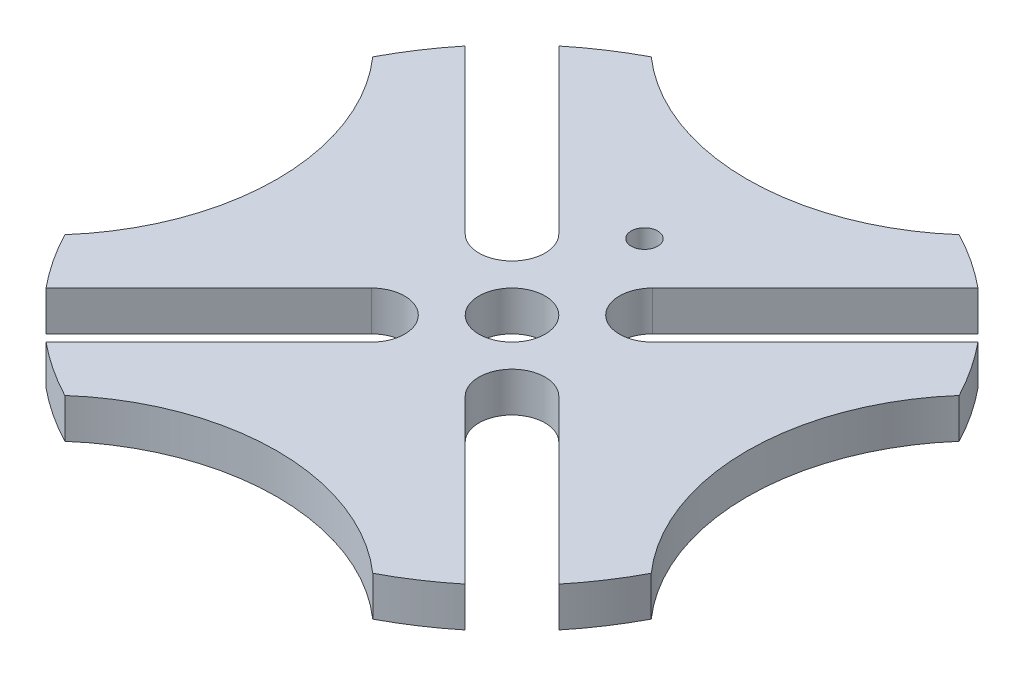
ISO-10303-21;
HEADER;
FILE_DESCRIPTION(('STEP AP214'),'2;1');
FILE_NAME('part.step','',(''),(''),'','','');
FILE_SCHEMA(('AUTOMOTIVE_DESIGN { 1 0 10303 214 1 1 1 1 }'));
ENDSEC;
DATA;
#1=APPLICATION_CONTEXT('core data for automotive mechanical design processes');
#2=APPLICATION_PROTOCOL_DEFINITION('international standard','automotive_design',2000,#1);
#3=PRODUCT_CONTEXT('',#1,'mechanical');
#4=PRODUCT('Part','Part','',(#3));
#5=PRODUCT_RELATED_PRODUCT_CATEGORY('part','',(#4));
#6=PRODUCT_DEFINITION_FORMATION('','',#4);
#7=PRODUCT_DEFINITION_CONTEXT('part definition',#1,'design');
#8=PRODUCT_DEFINITION('design','',#6,#7);
#9=PRODUCT_DEFINITION_SHAPE('','',#8);
#10=(LENGTH_UNIT() NAMED_UNIT(*) SI_UNIT(.MILLI.,.METRE.));
#11=(NAMED_UNIT(*) PLANE_ANGLE_UNIT() SI_UNIT($,.RADIAN.));
#12=(NAMED_UNIT(*) SI_UNIT($,.STERADIAN.) SOLID_ANGLE_UNIT());
#13=UNCERTAINTY_MEASURE_WITH_UNIT(LENGTH_MEASURE(1.E-05),#10,'distance_accuracy_value','');
#14=(GEOMETRIC_REPRESENTATION_CONTEXT(3) GLOBAL_UNCERTAINTY_ASSIGNED_CONTEXT((#13)) GLOBAL_UNIT_ASSIGNED_CONTEXT((#10,
#11,#12)) REPRESENTATION_CONTEXT('',''));
#15=CARTESIAN_POINT('',(0.,0.,0.));
#16=DIRECTION('',(0.,0.,1.));
#17=DIRECTION('',(1.,0.,0.));
#18=AXIS2_PLACEMENT_3D('',#15,#16,#17);
#19=CARTESIAN_POINT('',(0.,6.,0.));
#20=DIRECTION('',(0.,-1.,0.));
#21=DIRECTION('',(0.,0.,-1.));
#22=AXIS2_PLACEMENT_3D('',#19,#20,#21);
#23=CYLINDRICAL_SURFACE('',#22,50.);
#24=CARTESIAN_POINT('',(0.,0.,0.));
#25=DIRECTION('',(0.,1.,0.));
#26=DIRECTION('',(0.,0.,1.));
#27=AXIS2_PLACEMENT_3D('',#24,#25,#26);
#28=CIRCLE('',#27,50.);
#29=CARTESIAN_POINT('',(-31.6425842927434,0.,38.7136521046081));
#30=VERTEX_POINT('',#29);
#31=CARTESIAN_POINT('',(-23.2459131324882,0.,44.2676803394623));
#32=VERTEX_POINT('',#31);
#33=EDGE_CURVE('E216',#30,#32,#28,.T.);
#34=ORIENTED_EDGE('',*,*,#33,.T.);
#35=DIRECTION('',(0.,1.,0.));
#36=VECTOR('',#35,1.);
#37=CARTESIAN_POINT('',(-23.2459131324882,3.,44.2676803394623));
#38=LINE('',#37,#36);
#39=CARTESIAN_POINT('',(-23.2459131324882,6.,44.2676803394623));
#40=VERTEX_POINT('',#39);
#41=EDGE_CURVE('E50',#32,#40,#38,.T.);
#42=ORIENTED_EDGE('',*,*,#41,.T.);
#43=CARTESIAN_POINT('',(0.,6.,0.));
#44=DIRECTION('',(0.,1.,0.));
#45=DIRECTION('',(0.,0.,1.));
#46=AXIS2_PLACEMENT_3D('',#43,#44,#45);
#47=CIRCLE('',#46,50.);
#48=CARTESIAN_POINT('',(-31.6425842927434,6.,38.7136521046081));
#49=VERTEX_POINT('',#48);
#50=EDGE_CURVE('E230',#49,#40,#47,.T.);
#51=ORIENTED_EDGE('',*,*,#50,.F.);
#52=DIRECTION('',(0.,1.,0.));
#53=VECTOR('',#52,1.);
#54=CARTESIAN_POINT('',(-31.6425842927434,0.,38.7136521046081));
#55=LINE('',#54,#53);
#56=EDGE_CURVE('E347',#30,#49,#55,.T.);
#57=ORIENTED_EDGE('',*,*,#56,.F.);
#58=EDGE_LOOP('',(#34,#42,#51,#57));
#59=FACE_BOUND('',#58,.T.);
#60=ADVANCED_FACE('F33',(#59),#23,.T.);
#61=CARTESIAN_POINT('',(38.7136521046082,0.,31.6425842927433));
#62=VERTEX_POINT('',#61);
#63=CARTESIAN_POINT('',(44.2676803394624,0.,23.245913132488));
#64=VERTEX_POINT('',#63);
#65=EDGE_CURVE('E217',#62,#64,#28,.T.);
#66=ORIENTED_EDGE('',*,*,#65,.T.);
#67=DIRECTION('',(0.,1.,0.));
#68=VECTOR('',#67,1.);
#69=CARTESIAN_POINT('',(44.2676803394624,3.,23.245913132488));
#70=LINE('',#69,#68);
#71=CARTESIAN_POINT('',(44.2676803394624,6.,23.245913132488));
#72=VERTEX_POINT('',#71);
#73=EDGE_CURVE('E58',#64,#72,#70,.T.);
#74=ORIENTED_EDGE('',*,*,#73,.T.);
#75=CARTESIAN_POINT('',(38.7136521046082,6.,31.6425842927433));
#76=VERTEX_POINT('',#75);
#77=EDGE_CURVE('E434',#76,#72,#47,.T.);
#78=ORIENTED_EDGE('',*,*,#77,.F.);
#79=DIRECTION('',(0.,1.,0.));
#80=VECTOR('',#79,1.);
#81=CARTESIAN_POINT('',(38.7136521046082,0.,31.6425842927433));
#82=LINE('',#81,#80);
#83=EDGE_CURVE('E324',#62,#76,#82,.T.);
#84=ORIENTED_EDGE('',*,*,#83,.F.);
#85=EDGE_LOOP('',(#66,#74,#78,#84));
#86=FACE_BOUND('',#85,.T.);
#87=ADVANCED_FACE('F447',(#86),#23,.T.);
#88=CARTESIAN_POINT('',(31.6425842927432,0.,-38.7136521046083));
#89=VERTEX_POINT('',#88);
#90=CARTESIAN_POINT('',(23.2459131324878,0.,-44.2676803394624));
#91=VERTEX_POINT('',#90);
#92=EDGE_CURVE('E222',#89,#91,#28,.T.);
#93=ORIENTED_EDGE('',*,*,#92,.T.);
#94=DIRECTION('',(0.,1.,0.));
#95=VECTOR('',#94,1.);
#96=CARTESIAN_POINT('',(23.2459131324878,3.,-44.2676803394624));
#97=LINE('',#96,#95);
#98=CARTESIAN_POINT('',(23.2459131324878,6.,-44.2676803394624));
#99=VERTEX_POINT('',#98);
#100=EDGE_CURVE('E359',#91,#99,#97,.T.);
#101=ORIENTED_EDGE('',*,*,#100,.T.);
#102=CARTESIAN_POINT('',(31.6425842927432,6.,-38.7136521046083));
#103=VERTEX_POINT('',#102);
#104=EDGE_CURVE('E229',#103,#99,#47,.T.);
#105=ORIENTED_EDGE('',*,*,#104,.F.);
#106=DIRECTION('',(0.,1.,0.));
#107=VECTOR('',#106,1.);
#108=CARTESIAN_POINT('',(31.6425842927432,0.,-38.7136521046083));
#109=LINE('',#108,#107);
#110=EDGE_CURVE('E298',#89,#103,#109,.T.);
#111=ORIENTED_EDGE('',*,*,#110,.F.);
#112=EDGE_LOOP('',(#93,#101,#105,#111));
#113=FACE_BOUND('',#112,.T.);
#114=ADVANCED_FACE('F463',(#113),#23,.T.);
#115=CARTESIAN_POINT('',(23.2459131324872,6.,44.2676803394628));
#116=VERTEX_POINT('',#115);
#117=CARTESIAN_POINT('',(31.6425842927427,6.,38.7136521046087));
#118=VERTEX_POINT('',#117);
#119=EDGE_CURVE('E43',#116,#118,#47,.T.);
#120=ORIENTED_EDGE('',*,*,#119,.F.);
#121=DIRECTION('',(0.,1.,0.));
#122=VECTOR('',#121,1.);
#123=CARTESIAN_POINT('',(23.2459131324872,3.,44.2676803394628));
#124=LINE('',#123,#122);
#125=CARTESIAN_POINT('',(23.2459131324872,0.,44.2676803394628));
#126=VERTEX_POINT('',#125);
#127=EDGE_CURVE('E196',#116,#126,#124,.F.);
#128=ORIENTED_EDGE('',*,*,#127,.T.);
#129=CARTESIAN_POINT('',(31.6425842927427,0.,38.7136521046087));
#130=VERTEX_POINT('',#129);
#131=EDGE_CURVE('E208',#126,#130,#28,.T.);
#132=ORIENTED_EDGE('',*,*,#131,.T.);
#133=DIRECTION('',(0.,1.,0.));
#134=VECTOR('',#133,1.);
#135=CARTESIAN_POINT('',(31.6425842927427,0.,38.7136521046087));
#136=LINE('',#135,#134);
#137=EDGE_CURVE('E321',#130,#118,#136,.T.);
#138=ORIENTED_EDGE('',*,*,#137,.T.);
#139=EDGE_LOOP('',(#120,#128,#132,#138));
#140=FACE_BOUND('',#139,.T.);
#141=ADVANCED_FACE('F206',(#140),#23,.T.);
#142=CARTESIAN_POINT('',(44.2676803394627,6.,-23.2459131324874));
#143=VERTEX_POINT('',#142);
#144=CARTESIAN_POINT('',(38.7136521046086,6.,-31.6425842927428));
#145=VERTEX_POINT('',#144);
#146=EDGE_CURVE('E231',#143,#145,#47,.T.);
#147=ORIENTED_EDGE('',*,*,#146,.F.);
#148=DIRECTION('',(0.,1.,0.));
#149=VECTOR('',#148,1.);
#150=CARTESIAN_POINT('',(44.2676803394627,3.,-23.2459131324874));
#151=LINE('',#150,#149);
#152=CARTESIAN_POINT('',(44.2676803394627,0.,-23.2459131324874));
#153=VERTEX_POINT('',#152);
#154=EDGE_CURVE('E376',#143,#153,#151,.F.);
#155=ORIENTED_EDGE('',*,*,#154,.T.);
#156=CARTESIAN_POINT('',(38.7136521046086,0.,-31.6425842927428));
#157=VERTEX_POINT('',#156);
#158=EDGE_CURVE('E218',#153,#157,#28,.T.);
#159=ORIENTED_EDGE('',*,*,#158,.T.);
#160=DIRECTION('',(0.,1.,0.));
#161=VECTOR('',#160,1.);
#162=CARTESIAN_POINT('',(38.7136521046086,0.,-31.6425842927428));
#163=LINE('',#162,#161);
#164=EDGE_CURVE('E294',#157,#145,#163,.T.);
#165=ORIENTED_EDGE('',*,*,#164,.T.);
#166=EDGE_LOOP('',(#147,#155,#159,#165));
#167=FACE_BOUND('',#166,.T.);
#168=ADVANCED_FACE('F452',(#167),#23,.T.);
#169=CARTESIAN_POINT('',(-23.2459131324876,6.,-44.2676803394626));
#170=VERTEX_POINT('',#169);
#171=CARTESIAN_POINT('',(-31.642584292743,6.,-38.7136521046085));
#172=VERTEX_POINT('',#171);
#173=EDGE_CURVE('E224',#170,#172,#47,.T.);
#174=ORIENTED_EDGE('',*,*,#173,.F.);
#175=DIRECTION('',(0.,1.,0.));
#176=VECTOR('',#175,1.);
#177=CARTESIAN_POINT('',(-23.2459131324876,3.,-44.2676803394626));
#178=LINE('',#177,#176);
#179=CARTESIAN_POINT('',(-23.2459131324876,0.,-44.2676803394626));
#180=VERTEX_POINT('',#179);
#181=EDGE_CURVE('E368',#170,#180,#178,.F.);
#182=ORIENTED_EDGE('',*,*,#181,.T.);
#183=CARTESIAN_POINT('',(-31.642584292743,0.,-38.7136521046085));
#184=VERTEX_POINT('',#183);
#185=EDGE_CURVE('E220',#180,#184,#28,.T.);
#186=ORIENTED_EDGE('',*,*,#185,.T.);
#187=DIRECTION('',(0.,1.,0.));
#188=VECTOR('',#187,1.);
#189=CARTESIAN_POINT('',(-31.642584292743,0.,-38.7136521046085));
#190=LINE('',#189,#188);
#191=EDGE_CURVE('E254',#184,#172,#190,.T.);
#192=ORIENTED_EDGE('',*,*,#191,.T.);
#193=EDGE_LOOP('',(#174,#182,#186,#192));
#194=FACE_BOUND('',#193,.T.);
#195=ADVANCED_FACE('F468',(#194),#23,.T.);
#196=CARTESIAN_POINT('',(-38.7136521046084,0.,-31.642584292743));
#197=VERTEX_POINT('',#196);
#198=CARTESIAN_POINT('',(-44.2676803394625,0.,-23.2459131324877));
#199=VERTEX_POINT('',#198);
#200=EDGE_CURVE('E37',#197,#199,#28,.T.);
#201=ORIENTED_EDGE('',*,*,#200,.T.);
#202=DIRECTION('',(0.,1.,0.));
#203=VECTOR('',#202,1.);
#204=CARTESIAN_POINT('',(-44.2676803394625,3.,-23.2459131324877));
#205=LINE('',#204,#203);
#206=CARTESIAN_POINT('',(-44.2676803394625,6.,-23.2459131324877));
#207=VERTEX_POINT('',#206);
#208=EDGE_CURVE('E277',#199,#207,#205,.T.);
#209=ORIENTED_EDGE('',*,*,#208,.T.);
#210=CARTESIAN_POINT('',(-38.7136521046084,6.,-31.642584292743));
#211=VERTEX_POINT('',#210);
#212=EDGE_CURVE('E11',#211,#207,#47,.T.);
#213=ORIENTED_EDGE('',*,*,#212,.F.);
#214=DIRECTION('',(0.,1.,0.));
#215=VECTOR('',#214,1.);
#216=CARTESIAN_POINT('',(-38.7136521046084,0.,-31.642584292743));
#217=LINE('',#216,#215);
#218=EDGE_CURVE('E248',#197,#211,#217,.T.);
#219=ORIENTED_EDGE('',*,*,#218,.F.);
#220=EDGE_LOOP('',(#201,#209,#213,#219));
#221=FACE_BOUND('',#220,.T.);
#222=ADVANCED_FACE('F485',(#221),#23,.T.);
#223=CARTESIAN_POINT('',(-44.2676803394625,0.,23.2459131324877));
#224=VERTEX_POINT('',#223);
#225=CARTESIAN_POINT('',(-38.7136521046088,0.,31.6425842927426));
#226=VERTEX_POINT('',#225);
#227=EDGE_CURVE('E219',#224,#226,#28,.T.);
#228=ORIENTED_EDGE('',*,*,#227,.T.);
#229=DIRECTION('',(0.,1.,0.));
#230=VECTOR('',#229,1.);
#231=CARTESIAN_POINT('',(-38.7136521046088,0.,31.6425842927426));
#232=LINE('',#231,#230);
#233=CARTESIAN_POINT('',(-38.7136521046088,6.,31.6425842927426));
#234=VERTEX_POINT('',#233);
#235=EDGE_CURVE('E344',#226,#234,#232,.T.);
#236=ORIENTED_EDGE('',*,*,#235,.T.);
#237=CARTESIAN_POINT('',(-44.2676803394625,6.,23.2459131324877));
#238=VERTEX_POINT('',#237);
#239=EDGE_CURVE('E42',#238,#234,#47,.T.);
#240=ORIENTED_EDGE('',*,*,#239,.F.);
#241=DIRECTION('',(0.,1.,0.));
#242=VECTOR('',#241,1.);
#243=CARTESIAN_POINT('',(-44.2676803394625,3.,23.2459131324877));
#244=LINE('',#243,#242);
#245=EDGE_CURVE('E284',#238,#224,#244,.F.);
#246=ORIENTED_EDGE('',*,*,#245,.T.);
#247=EDGE_LOOP('',(#228,#236,#240,#246));
#248=FACE_BOUND('',#247,.T.);
#249=ADVANCED_FACE('F35',(#248),#23,.T.);
#250=CARTESIAN_POINT('',(0.,6.,0.));
#251=DIRECTION('',(0.,1.,0.));
#252=DIRECTION('',(0.,0.,1.));
#253=AXIS2_PLACEMENT_3D('',#250,#251,#252);
#254=PLANE('',#253);
#255=CARTESIAN_POINT('',(0.,6.,-20.));
#256=DIRECTION('',(0.,1.,0.));
#257=DIRECTION('',(0.,0.,1.));
#258=AXIS2_PLACEMENT_3D('',#255,#256,#257);
#259=CIRCLE('',#258,2.);
#260=CARTESIAN_POINT('',(0.,6.,-18.));
#261=VERTEX_POINT('',#260);
#262=EDGE_CURVE('E392',#261,#261,#259,.T.);
#263=ORIENTED_EDGE('',*,*,#262,.F.);
#264=EDGE_LOOP('',(#263));
#265=FACE_BOUND('',#264,.T.);
#266=CARTESIAN_POINT('',(0.,6.,0.));
#267=DIRECTION('',(0.,1.,0.));
#268=DIRECTION('',(0.,0.,1.));
#269=AXIS2_PLACEMENT_3D('',#266,#267,#268);
#270=CIRCLE('',#269,5.);
#271=CARTESIAN_POINT('',(0.,6.,5.));
#272=VERTEX_POINT('',#271);
#273=EDGE_CURVE('E386',#272,#272,#270,.T.);
#274=ORIENTED_EDGE('',*,*,#273,.F.);
#275=EDGE_LOOP('',(#274));
#276=FACE_BOUND('',#275,.T.);
#277=CARTESIAN_POINT('',(-7.31885653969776E-13,6.,70.7));
#278=DIRECTION('',(0.,1.,0.));
#279=DIRECTION('',(1.,0.,0.));
#280=AXIS2_PLACEMENT_3D('',#277,#278,#279);
#281=CIRCLE('',#280,35.2);
#282=EDGE_CURVE('E202',#116,#40,#281,.T.);
#283=ORIENTED_EDGE('',*,*,#282,.F.);
#284=ORIENTED_EDGE('',*,*,#119,.T.);
#285=DIRECTION('',(0.707106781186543,0.,0.707106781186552));
#286=VECTOR('',#285,1.);
#287=CARTESIAN_POINT('',(7.07106781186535,6.,14.142135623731));
#288=LINE('',#287,#286);
#289=CARTESIAN_POINT('',(7.07106781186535,6.,14.142135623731));
#290=VERTEX_POINT('',#289);
#291=EDGE_CURVE('E331',#290,#118,#288,.T.);
#292=ORIENTED_EDGE('',*,*,#291,.F.);
#293=CARTESIAN_POINT('',(10.6066017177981,6.,10.6066017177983));
#294=DIRECTION('',(0.,1.,0.));
#295=DIRECTION('',(0.,0.,-1.));
#296=AXIS2_PLACEMENT_3D('',#293,#294,#295);
#297=CIRCLE('',#296,5.);
#298=CARTESIAN_POINT('',(14.1421356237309,6.,7.0710678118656));
#299=VERTEX_POINT('',#298);
#300=EDGE_CURVE('E334',#299,#290,#297,.T.);
#301=ORIENTED_EDGE('',*,*,#300,.F.);
#302=DIRECTION('',(-0.707106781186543,0.,-0.707106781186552));
#303=VECTOR('',#302,1.);
#304=CARTESIAN_POINT('',(38.7136521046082,6.,31.6425842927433));
#305=LINE('',#304,#303);
#306=EDGE_CURVE('E327',#76,#299,#305,.T.);
#307=ORIENTED_EDGE('',*,*,#306,.F.);
#308=ORIENTED_EDGE('',*,*,#77,.T.);
#309=CARTESIAN_POINT('',(70.7,6.,4.85037780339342E-13));
#310=DIRECTION('',(0.,1.,0.));
#311=DIRECTION('',(0.,0.,-1.));
#312=AXIS2_PLACEMENT_3D('',#309,#310,#311);
#313=CIRCLE('',#312,35.2);
#314=EDGE_CURVE('E380',#143,#72,#313,.T.);
#315=ORIENTED_EDGE('',*,*,#314,.F.);
#316=ORIENTED_EDGE('',*,*,#146,.T.);
#317=DIRECTION('',(0.70710678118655,0.,-0.707106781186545));
#318=VECTOR('',#317,1.);
#319=CARTESIAN_POINT('',(14.142135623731,6.,-7.0710678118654));
#320=LINE('',#319,#318);
#321=CARTESIAN_POINT('',(14.142135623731,6.,-7.0710678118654));
#322=VERTEX_POINT('',#321);
#323=EDGE_CURVE('E305',#322,#145,#320,.T.);
#324=ORIENTED_EDGE('',*,*,#323,.F.);
#325=CARTESIAN_POINT('',(10.6066017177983,6.,-10.6066017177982));
#326=DIRECTION('',(0.,1.,0.));
#327=DIRECTION('',(-1.,0.,0.));
#328=AXIS2_PLACEMENT_3D('',#325,#326,#327);
#329=CIRCLE('',#328,5.);
#330=CARTESIAN_POINT('',(7.07106781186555,6.,-14.1421356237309));
#331=VERTEX_POINT('',#330);
#332=EDGE_CURVE('E308',#331,#322,#329,.T.);
#333=ORIENTED_EDGE('',*,*,#332,.F.);
#334=DIRECTION('',(-0.70710678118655,0.,0.707106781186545));
#335=VECTOR('',#334,1.);
#336=CARTESIAN_POINT('',(31.6425842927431,6.,-38.7136521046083));
#337=LINE('',#336,#335);
#338=EDGE_CURVE('E301',#103,#331,#337,.T.);
#339=ORIENTED_EDGE('',*,*,#338,.F.);
#340=ORIENTED_EDGE('',*,*,#104,.T.);
#341=CARTESIAN_POINT('',(2.38189906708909E-13,6.,-70.7));
#342=DIRECTION('',(0.,1.,0.));
#343=DIRECTION('',(-1.,0.,0.));
#344=AXIS2_PLACEMENT_3D('',#341,#342,#343);
#345=CIRCLE('',#344,35.2);
#346=EDGE_CURVE('E371',#170,#99,#345,.T.);
#347=ORIENTED_EDGE('',*,*,#346,.F.);
#348=ORIENTED_EDGE('',*,*,#173,.T.);
#349=DIRECTION('',(-0.707106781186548,0.,-0.707106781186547));
#350=VECTOR('',#349,1.);
#351=CARTESIAN_POINT('',(-7.07106781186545,6.,-14.142135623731));
#352=LINE('',#351,#350);
#353=CARTESIAN_POINT('',(-7.07106781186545,6.,-14.142135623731));
#354=VERTEX_POINT('',#353);
#355=EDGE_CURVE('E276',#354,#172,#352,.T.);
#356=ORIENTED_EDGE('',*,*,#355,.F.);
#357=CARTESIAN_POINT('',(-10.6066017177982,6.,-10.6066017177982));
#358=DIRECTION('',(0.,1.,0.));
#359=DIRECTION('',(0.,0.,1.));
#360=AXIS2_PLACEMENT_3D('',#357,#358,#359);
#361=CIRCLE('',#360,5.);
#362=CARTESIAN_POINT('',(-14.1421356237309,6.,-7.0710678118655));
#363=VERTEX_POINT('',#362);
#364=EDGE_CURVE('E275',#363,#354,#361,.T.);
#365=ORIENTED_EDGE('',*,*,#364,.F.);
#366=DIRECTION('',(0.707106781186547,0.,0.707106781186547));
#367=VECTOR('',#366,1.);
#368=CARTESIAN_POINT('',(-38.7136521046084,6.,-31.642584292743));
#369=LINE('',#368,#367);
#370=EDGE_CURVE('E257',#211,#363,#369,.T.);
#371=ORIENTED_EDGE('',*,*,#370,.F.);
#372=ORIENTED_EDGE('',*,*,#212,.T.);
#373=CARTESIAN_POINT('',(-70.7,6.,0.));
#374=DIRECTION('',(0.,1.,0.));
#375=DIRECTION('',(0.,0.,1.));
#376=AXIS2_PLACEMENT_3D('',#373,#374,#375);
#377=CIRCLE('',#376,35.2);
#378=EDGE_CURVE('E287',#238,#207,#377,.T.);
#379=ORIENTED_EDGE('',*,*,#378,.F.);
#380=ORIENTED_EDGE('',*,*,#239,.T.);
#381=DIRECTION('',(-0.707106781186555,0.,0.70710678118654));
#382=VECTOR('',#381,1.);
#383=CARTESIAN_POINT('',(-14.142135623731,6.,7.0710678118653));
#384=LINE('',#383,#382);
#385=CARTESIAN_POINT('',(-14.142135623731,6.,7.0710678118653));
#386=VERTEX_POINT('',#385);
#387=EDGE_CURVE('E354',#386,#234,#384,.T.);
#388=ORIENTED_EDGE('',*,*,#387,.F.);
#389=CARTESIAN_POINT('',(-10.6066017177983,6.,10.6066017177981));
#390=DIRECTION('',(0.,1.,0.));
#391=DIRECTION('',(1.,0.,0.));
#392=AXIS2_PLACEMENT_3D('',#389,#390,#391);
#393=CIRCLE('',#392,5.);
#394=CARTESIAN_POINT('',(-7.07106781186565,6.,14.1421356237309));
#395=VERTEX_POINT('',#394);
#396=EDGE_CURVE('E356',#395,#386,#393,.T.);
#397=ORIENTED_EDGE('',*,*,#396,.F.);
#398=DIRECTION('',(0.707106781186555,0.,-0.70710678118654));
#399=VECTOR('',#398,1.);
#400=CARTESIAN_POINT('',(-31.6425842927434,6.,38.7136521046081));
#401=LINE('',#400,#399);
#402=EDGE_CURVE('E350',#49,#395,#401,.T.);
#403=ORIENTED_EDGE('',*,*,#402,.F.);
#404=ORIENTED_EDGE('',*,*,#50,.T.);
#405=EDGE_LOOP('',(#283,#284,#292,#301,#307,#308,#315,#316,#324,#333,#339,#340,#347,#348,#356,
#365,#371,#372,#379,#380,#388,#397,#403,#404));
#406=FACE_BOUND('',#405,.T.);
#407=ADVANCED_FACE('F407',(#265,#276,#406),#254,.T.);
#408=CARTESIAN_POINT('',(0.,0.,0.));
#409=DIRECTION('',(0.,1.,0.));
#410=DIRECTION('',(0.,0.,1.));
#411=AXIS2_PLACEMENT_3D('',#408,#409,#410);
#412=PLANE('',#411);
#413=CARTESIAN_POINT('',(0.,0.,-20.));
#414=DIRECTION('',(0.,1.,0.));
#415=DIRECTION('',(0.,0.,1.));
#416=AXIS2_PLACEMENT_3D('',#413,#414,#415);
#417=CIRCLE('',#416,2.);
#418=CARTESIAN_POINT('',(0.,0.,-18.));
#419=VERTEX_POINT('',#418);
#420=EDGE_CURVE('E389',#419,#419,#417,.T.);
#421=ORIENTED_EDGE('',*,*,#420,.T.);
#422=EDGE_LOOP('',(#421));
#423=FACE_BOUND('',#422,.T.);
#424=CARTESIAN_POINT('',(0.,0.,0.));
#425=DIRECTION('',(0.,1.,0.));
#426=DIRECTION('',(0.,0.,1.));
#427=AXIS2_PLACEMENT_3D('',#424,#425,#426);
#428=CIRCLE('',#427,5.);
#429=CARTESIAN_POINT('',(0.,0.,5.));
#430=VERTEX_POINT('',#429);
#431=EDGE_CURVE('E384',#430,#430,#428,.T.);
#432=ORIENTED_EDGE('',*,*,#431,.T.);
#433=EDGE_LOOP('',(#432));
#434=FACE_BOUND('',#433,.T.);
#435=ORIENTED_EDGE('',*,*,#131,.F.);
#436=CARTESIAN_POINT('',(-7.31885653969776E-13,0.,70.7));
#437=DIRECTION('',(0.,1.,0.));
#438=DIRECTION('',(1.,0.,0.));
#439=AXIS2_PLACEMENT_3D('',#436,#437,#438);
#440=CIRCLE('',#439,35.2);
#441=EDGE_CURVE('E193',#126,#32,#440,.T.);
#442=ORIENTED_EDGE('',*,*,#441,.T.);
#443=ORIENTED_EDGE('',*,*,#33,.F.);
#444=DIRECTION('',(0.707106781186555,0.,-0.70710678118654));
#445=VECTOR('',#444,1.);
#446=CARTESIAN_POINT('',(-31.6425842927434,0.,38.7136521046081));
#447=LINE('',#446,#445);
#448=CARTESIAN_POINT('',(-7.07106781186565,0.,14.1421356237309));
#449=VERTEX_POINT('',#448);
#450=EDGE_CURVE('E345',#30,#449,#447,.T.);
#451=ORIENTED_EDGE('',*,*,#450,.T.);
#452=CARTESIAN_POINT('',(-10.6066017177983,0.,10.6066017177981));
#453=DIRECTION('',(0.,1.,0.));
#454=DIRECTION('',(1.,0.,0.));
#455=AXIS2_PLACEMENT_3D('',#452,#453,#454);
#456=CIRCLE('',#455,5.);
#457=CARTESIAN_POINT('',(-14.142135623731,0.,7.0710678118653));
#458=VERTEX_POINT('',#457);
#459=EDGE_CURVE('E353',#449,#458,#456,.T.);
#460=ORIENTED_EDGE('',*,*,#459,.T.);
#461=DIRECTION('',(-0.707106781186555,0.,0.70710678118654));
#462=VECTOR('',#461,1.);
#463=CARTESIAN_POINT('',(-14.142135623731,0.,7.0710678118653));
#464=LINE('',#463,#462);
#465=EDGE_CURVE('E362',#458,#226,#464,.T.);
#466=ORIENTED_EDGE('',*,*,#465,.T.);
#467=ORIENTED_EDGE('',*,*,#227,.F.);
#468=CARTESIAN_POINT('',(-70.7,0.,0.));
#469=DIRECTION('',(0.,1.,0.));
#470=DIRECTION('',(0.,0.,1.));
#471=AXIS2_PLACEMENT_3D('',#468,#469,#470);
#472=CIRCLE('',#471,35.2);
#473=EDGE_CURVE('E286',#224,#199,#472,.T.);
#474=ORIENTED_EDGE('',*,*,#473,.T.);
#475=ORIENTED_EDGE('',*,*,#200,.F.);
#476=DIRECTION('',(0.707106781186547,0.,0.707106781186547));
#477=VECTOR('',#476,1.);
#478=CARTESIAN_POINT('',(-38.7136521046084,0.,-31.642584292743));
#479=LINE('',#478,#477);
#480=CARTESIAN_POINT('',(-14.1421356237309,0.,-7.0710678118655));
#481=VERTEX_POINT('',#480);
#482=EDGE_CURVE('E262',#197,#481,#479,.T.);
#483=ORIENTED_EDGE('',*,*,#482,.T.);
#484=CARTESIAN_POINT('',(-10.6066017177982,0.,-10.6066017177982));
#485=DIRECTION('',(0.,1.,0.));
#486=DIRECTION('',(0.,0.,1.));
#487=AXIS2_PLACEMENT_3D('',#484,#485,#486);
#488=CIRCLE('',#487,5.);
#489=CARTESIAN_POINT('',(-7.07106781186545,0.,-14.142135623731));
#490=VERTEX_POINT('',#489);
#491=EDGE_CURVE('E271',#481,#490,#488,.T.);
#492=ORIENTED_EDGE('',*,*,#491,.T.);
#493=DIRECTION('',(-0.707106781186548,0.,-0.707106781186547));
#494=VECTOR('',#493,1.);
#495=CARTESIAN_POINT('',(-7.07106781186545,0.,-14.142135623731));
#496=LINE('',#495,#494);
#497=EDGE_CURVE('E267',#490,#184,#496,.T.);
#498=ORIENTED_EDGE('',*,*,#497,.T.);
#499=ORIENTED_EDGE('',*,*,#185,.F.);
#500=CARTESIAN_POINT('',(2.38189906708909E-13,0.,-70.7));
#501=DIRECTION('',(0.,1.,0.));
#502=DIRECTION('',(-1.,0.,0.));
#503=AXIS2_PLACEMENT_3D('',#500,#501,#502);
#504=CIRCLE('',#503,35.2);
#505=EDGE_CURVE('E370',#180,#91,#504,.T.);
#506=ORIENTED_EDGE('',*,*,#505,.T.);
#507=ORIENTED_EDGE('',*,*,#92,.F.);
#508=DIRECTION('',(-0.70710678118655,0.,0.707106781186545));
#509=VECTOR('',#508,1.);
#510=CARTESIAN_POINT('',(31.6425842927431,0.,-38.7136521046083));
#511=LINE('',#510,#509);
#512=CARTESIAN_POINT('',(7.07106781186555,0.,-14.1421356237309));
#513=VERTEX_POINT('',#512);
#514=EDGE_CURVE('E295',#89,#513,#511,.T.);
#515=ORIENTED_EDGE('',*,*,#514,.T.);
#516=CARTESIAN_POINT('',(10.6066017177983,0.,-10.6066017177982));
#517=DIRECTION('',(0.,1.,0.));
#518=DIRECTION('',(-1.,0.,0.));
#519=AXIS2_PLACEMENT_3D('',#516,#517,#518);
#520=CIRCLE('',#519,5.);
#521=CARTESIAN_POINT('',(14.142135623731,0.,-7.0710678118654));
#522=VERTEX_POINT('',#521);
#523=EDGE_CURVE('E304',#513,#522,#520,.T.);
#524=ORIENTED_EDGE('',*,*,#523,.T.);
#525=DIRECTION('',(0.70710678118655,0.,-0.707106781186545));
#526=VECTOR('',#525,1.);
#527=CARTESIAN_POINT('',(14.142135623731,0.,-7.0710678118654));
#528=LINE('',#527,#526);
#529=EDGE_CURVE('E314',#522,#157,#528,.T.);
#530=ORIENTED_EDGE('',*,*,#529,.T.);
#531=ORIENTED_EDGE('',*,*,#158,.F.);
#532=CARTESIAN_POINT('',(70.7,0.,4.85037780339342E-13));
#533=DIRECTION('',(0.,1.,0.));
#534=DIRECTION('',(0.,0.,-1.));
#535=AXIS2_PLACEMENT_3D('',#532,#533,#534);
#536=CIRCLE('',#535,35.2);
#537=EDGE_CURVE('E379',#153,#64,#536,.T.);
#538=ORIENTED_EDGE('',*,*,#537,.T.);
#539=ORIENTED_EDGE('',*,*,#65,.F.);
#540=DIRECTION('',(-0.707106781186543,0.,-0.707106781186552));
#541=VECTOR('',#540,1.);
#542=CARTESIAN_POINT('',(38.7136521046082,0.,31.6425842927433));
#543=LINE('',#542,#541);
#544=CARTESIAN_POINT('',(14.1421356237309,0.,7.0710678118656));
#545=VERTEX_POINT('',#544);
#546=EDGE_CURVE('E322',#62,#545,#543,.T.);
#547=ORIENTED_EDGE('',*,*,#546,.T.);
#548=CARTESIAN_POINT('',(10.6066017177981,0.,10.6066017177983));
#549=DIRECTION('',(0.,1.,0.));
#550=DIRECTION('',(0.,0.,-1.));
#551=AXIS2_PLACEMENT_3D('',#548,#549,#550);
#552=CIRCLE('',#551,5.);
#553=CARTESIAN_POINT('',(7.07106781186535,0.,14.142135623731));
#554=VERTEX_POINT('',#553);
#555=EDGE_CURVE('E330',#545,#554,#552,.T.);
#556=ORIENTED_EDGE('',*,*,#555,.T.);
#557=DIRECTION('',(0.707106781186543,0.,0.707106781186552));
#558=VECTOR('',#557,1.);
#559=CARTESIAN_POINT('',(7.07106781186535,0.,14.142135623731));
#560=LINE('',#559,#558);
#561=EDGE_CURVE('E215',#554,#130,#560,.T.);
#562=ORIENTED_EDGE('',*,*,#561,.T.);
#563=EDGE_LOOP('',(#435,#442,#443,#451,#460,#466,#467,#474,#475,#483,#492,#498,#499,#506,#507,
#515,#524,#530,#531,#538,#539,#547,#556,#562));
#564=FACE_BOUND('',#563,.T.);
#565=ADVANCED_FACE('F212',(#423,#434,#564),#412,.F.);
#566=CARTESIAN_POINT('',(-10.6066017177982,0.,-10.6066017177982));
#567=DIRECTION('',(0.,1.,0.));
#568=DIRECTION('',(0.,0.,1.));
#569=AXIS2_PLACEMENT_3D('',#566,#567,#568);
#570=CYLINDRICAL_SURFACE('',#569,5.);
#571=ORIENTED_EDGE('',*,*,#364,.T.);
#572=DIRECTION('',(0.,1.,0.));
#573=VECTOR('',#572,1.);
#574=CARTESIAN_POINT('',(-7.07106781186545,0.,-14.142135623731));
#575=LINE('',#574,#573);
#576=EDGE_CURVE('E261',#490,#354,#575,.T.);
#577=ORIENTED_EDGE('',*,*,#576,.F.);
#578=ORIENTED_EDGE('',*,*,#491,.F.);
#579=DIRECTION('',(0.,1.,0.));
#580=VECTOR('',#579,1.);
#581=CARTESIAN_POINT('',(-14.1421356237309,0.,-7.0710678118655));
#582=LINE('',#581,#580);
#583=EDGE_CURVE('E242',#481,#363,#582,.T.);
#584=ORIENTED_EDGE('',*,*,#583,.T.);
#585=EDGE_LOOP('',(#571,#577,#578,#584));
#586=FACE_BOUND('',#585,.T.);
#587=ADVANCED_FACE('F470',(#586),#570,.F.);
#588=CARTESIAN_POINT('',(-38.7136521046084,0.,-31.642584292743));
#589=DIRECTION('',(-0.707106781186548,0.,0.707106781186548));
#590=DIRECTION('',(0.707106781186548,0.,0.707106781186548));
#591=AXIS2_PLACEMENT_3D('',#588,#589,#590);
#592=PLANE('',#591);
#593=ORIENTED_EDGE('',*,*,#370,.T.);
#594=ORIENTED_EDGE('',*,*,#583,.F.);
#595=ORIENTED_EDGE('',*,*,#482,.F.);
#596=ORIENTED_EDGE('',*,*,#218,.T.);
#597=EDGE_LOOP('',(#593,#594,#595,#596));
#598=FACE_BOUND('',#597,.T.);
#599=ADVANCED_FACE('F472',(#598),#592,.F.);
#600=CARTESIAN_POINT('',(-7.07106781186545,0.,-14.142135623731));
#601=DIRECTION('',(0.707106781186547,0.,-0.707106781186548));
#602=DIRECTION('',(-0.707106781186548,0.,-0.707106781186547));
#603=AXIS2_PLACEMENT_3D('',#600,#601,#602);
#604=PLANE('',#603);
#605=ORIENTED_EDGE('',*,*,#355,.T.);
#606=ORIENTED_EDGE('',*,*,#191,.F.);
#607=ORIENTED_EDGE('',*,*,#497,.F.);
#608=ORIENTED_EDGE('',*,*,#576,.T.);
#609=EDGE_LOOP('',(#605,#606,#607,#608));
#610=FACE_BOUND('',#609,.T.);
#611=ADVANCED_FACE('F466',(#610),#604,.F.);
#612=CARTESIAN_POINT('',(-70.7,0.,0.));
#613=DIRECTION('',(0.,1.,0.));
#614=DIRECTION('',(0.,0.,1.));
#615=AXIS2_PLACEMENT_3D('',#612,#613,#614);
#616=CYLINDRICAL_SURFACE('',#615,35.2);
#617=ORIENTED_EDGE('',*,*,#473,.F.);
#618=ORIENTED_EDGE('',*,*,#245,.F.);
#619=ORIENTED_EDGE('',*,*,#378,.T.);
#620=ORIENTED_EDGE('',*,*,#208,.F.);
#621=EDGE_LOOP('',(#617,#618,#619,#620));
#622=FACE_BOUND('',#621,.T.);
#623=ADVANCED_FACE('F430',(#622),#616,.F.);
#624=CARTESIAN_POINT('',(10.6066017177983,0.,-10.6066017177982));
#625=DIRECTION('',(0.,1.,0.));
#626=DIRECTION('',(0.,0.,1.));
#627=AXIS2_PLACEMENT_3D('',#624,#625,#626);
#628=CYLINDRICAL_SURFACE('',#627,5.);
#629=ORIENTED_EDGE('',*,*,#332,.T.);
#630=DIRECTION('',(0.,1.,0.));
#631=VECTOR('',#630,1.);
#632=CARTESIAN_POINT('',(14.142135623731,0.,-7.0710678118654));
#633=LINE('',#632,#631);
#634=EDGE_CURVE('E292',#522,#322,#633,.T.);
#635=ORIENTED_EDGE('',*,*,#634,.F.);
#636=ORIENTED_EDGE('',*,*,#523,.F.);
#637=DIRECTION('',(0.,1.,0.));
#638=VECTOR('',#637,1.);
#639=CARTESIAN_POINT('',(7.07106781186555,0.,-14.1421356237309));
#640=LINE('',#639,#638);
#641=EDGE_CURVE('E289',#513,#331,#640,.T.);
#642=ORIENTED_EDGE('',*,*,#641,.T.);
#643=EDGE_LOOP('',(#629,#635,#636,#642));
#644=FACE_BOUND('',#643,.T.);
#645=ADVANCED_FACE('F461',(#644),#628,.F.);
#646=CARTESIAN_POINT('',(31.6425842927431,0.,-38.7136521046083));
#647=DIRECTION('',(-0.707106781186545,0.,-0.70710678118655));
#648=DIRECTION('',(-0.70710678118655,0.,0.707106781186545));
#649=AXIS2_PLACEMENT_3D('',#646,#647,#648);
#650=PLANE('',#649);
#651=ORIENTED_EDGE('',*,*,#338,.T.);
#652=ORIENTED_EDGE('',*,*,#641,.F.);
#653=ORIENTED_EDGE('',*,*,#514,.F.);
#654=ORIENTED_EDGE('',*,*,#110,.T.);
#655=EDGE_LOOP('',(#651,#652,#653,#654));
#656=FACE_BOUND('',#655,.T.);
#657=ADVANCED_FACE('F568',(#656),#650,.F.);
#658=CARTESIAN_POINT('',(14.142135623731,0.,-7.0710678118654));
#659=DIRECTION('',(0.707106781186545,0.,0.70710678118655));
#660=DIRECTION('',(0.70710678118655,0.,-0.707106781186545));
#661=AXIS2_PLACEMENT_3D('',#658,#659,#660);
#662=PLANE('',#661);
#663=ORIENTED_EDGE('',*,*,#323,.T.);
#664=ORIENTED_EDGE('',*,*,#164,.F.);
#665=ORIENTED_EDGE('',*,*,#529,.F.);
#666=ORIENTED_EDGE('',*,*,#634,.T.);
#667=EDGE_LOOP('',(#663,#664,#665,#666));
#668=FACE_BOUND('',#667,.T.);
#669=ADVANCED_FACE('F457',(#668),#662,.F.);
#670=CARTESIAN_POINT('',(10.6066017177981,0.,10.6066017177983));
#671=DIRECTION('',(0.,1.,0.));
#672=DIRECTION('',(0.,0.,1.));
#673=AXIS2_PLACEMENT_3D('',#670,#671,#672);
#674=CYLINDRICAL_SURFACE('',#673,5.);
#675=ORIENTED_EDGE('',*,*,#300,.T.);
#676=DIRECTION('',(0.,1.,0.));
#677=VECTOR('',#676,1.);
#678=CARTESIAN_POINT('',(7.07106781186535,0.,14.142135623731));
#679=LINE('',#678,#677);
#680=EDGE_CURVE('E319',#554,#290,#679,.T.);
#681=ORIENTED_EDGE('',*,*,#680,.F.);
#682=ORIENTED_EDGE('',*,*,#555,.F.);
#683=DIRECTION('',(0.,1.,0.));
#684=VECTOR('',#683,1.);
#685=CARTESIAN_POINT('',(14.1421356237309,0.,7.0710678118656));
#686=LINE('',#685,#684);
#687=EDGE_CURVE('E311',#545,#299,#686,.T.);
#688=ORIENTED_EDGE('',*,*,#687,.T.);
#689=EDGE_LOOP('',(#675,#681,#682,#688));
#690=FACE_BOUND('',#689,.T.);
#691=ADVANCED_FACE('F586',(#690),#674,.F.);
#692=CARTESIAN_POINT('',(38.7136521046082,0.,31.6425842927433));
#693=DIRECTION('',(0.707106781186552,0.,-0.707106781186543));
#694=DIRECTION('',(-0.707106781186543,0.,-0.707106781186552));
#695=AXIS2_PLACEMENT_3D('',#692,#693,#694);
#696=PLANE('',#695);
#697=ORIENTED_EDGE('',*,*,#306,.T.);
#698=ORIENTED_EDGE('',*,*,#687,.F.);
#699=ORIENTED_EDGE('',*,*,#546,.F.);
#700=ORIENTED_EDGE('',*,*,#83,.T.);
#701=EDGE_LOOP('',(#697,#698,#699,#700));
#702=FACE_BOUND('',#701,.T.);
#703=ADVANCED_FACE('F595',(#702),#696,.F.);
#704=CARTESIAN_POINT('',(7.07106781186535,0.,14.142135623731));
#705=DIRECTION('',(-0.707106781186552,0.,0.707106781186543));
#706=DIRECTION('',(0.707106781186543,0.,0.707106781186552));
#707=AXIS2_PLACEMENT_3D('',#704,#705,#706);
#708=PLANE('',#707);
#709=ORIENTED_EDGE('',*,*,#291,.T.);
#710=ORIENTED_EDGE('',*,*,#137,.F.);
#711=ORIENTED_EDGE('',*,*,#561,.F.);
#712=ORIENTED_EDGE('',*,*,#680,.T.);
#713=EDGE_LOOP('',(#709,#710,#711,#712));
#714=FACE_BOUND('',#713,.T.);
#715=ADVANCED_FACE('F605',(#714),#708,.F.);
#716=CARTESIAN_POINT('',(-10.6066017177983,0.,10.6066017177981));
#717=DIRECTION('',(0.,1.,0.));
#718=DIRECTION('',(0.,0.,1.));
#719=AXIS2_PLACEMENT_3D('',#716,#717,#718);
#720=CYLINDRICAL_SURFACE('',#719,5.);
#721=ORIENTED_EDGE('',*,*,#396,.T.);
#722=DIRECTION('',(0.,1.,0.));
#723=VECTOR('',#722,1.);
#724=CARTESIAN_POINT('',(-14.142135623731,0.,7.0710678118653));
#725=LINE('',#724,#723);
#726=EDGE_CURVE('E342',#458,#386,#725,.T.);
#727=ORIENTED_EDGE('',*,*,#726,.F.);
#728=ORIENTED_EDGE('',*,*,#459,.F.);
#729=DIRECTION('',(0.,1.,0.));
#730=VECTOR('',#729,1.);
#731=CARTESIAN_POINT('',(-7.07106781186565,0.,14.1421356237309));
#732=LINE('',#731,#730);
#733=EDGE_CURVE('E337',#449,#395,#732,.T.);
#734=ORIENTED_EDGE('',*,*,#733,.T.);
#735=EDGE_LOOP('',(#721,#727,#728,#734));
#736=FACE_BOUND('',#735,.T.);
#737=ADVANCED_FACE('F424',(#736),#720,.F.);
#738=CARTESIAN_POINT('',(-31.6425842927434,0.,38.7136521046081));
#739=DIRECTION('',(0.70710678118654,0.,0.707106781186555));
#740=DIRECTION('',(0.707106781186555,0.,-0.70710678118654));
#741=AXIS2_PLACEMENT_3D('',#738,#739,#740);
#742=PLANE('',#741);
#743=ORIENTED_EDGE('',*,*,#402,.T.);
#744=ORIENTED_EDGE('',*,*,#733,.F.);
#745=ORIENTED_EDGE('',*,*,#450,.F.);
#746=ORIENTED_EDGE('',*,*,#56,.T.);
#747=EDGE_LOOP('',(#743,#744,#745,#746));
#748=FACE_BOUND('',#747,.T.);
#749=ADVANCED_FACE('F421',(#748),#742,.F.);
#750=CARTESIAN_POINT('',(-14.142135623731,0.,7.0710678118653));
#751=DIRECTION('',(-0.70710678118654,0.,-0.707106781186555));
#752=DIRECTION('',(-0.707106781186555,0.,0.70710678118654));
#753=AXIS2_PLACEMENT_3D('',#750,#751,#752);
#754=PLANE('',#753);
#755=ORIENTED_EDGE('',*,*,#387,.T.);
#756=ORIENTED_EDGE('',*,*,#235,.F.);
#757=ORIENTED_EDGE('',*,*,#465,.F.);
#758=ORIENTED_EDGE('',*,*,#726,.T.);
#759=EDGE_LOOP('',(#755,#756,#757,#758));
#760=FACE_BOUND('',#759,.T.);
#761=ADVANCED_FACE('F428',(#760),#754,.F.);
#762=CARTESIAN_POINT('',(2.38189906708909E-13,0.,-70.7));
#763=DIRECTION('',(0.,1.,0.));
#764=DIRECTION('',(0.,0.,1.));
#765=AXIS2_PLACEMENT_3D('',#762,#763,#764);
#766=CYLINDRICAL_SURFACE('',#765,35.2);
#767=ORIENTED_EDGE('',*,*,#505,.F.);
#768=ORIENTED_EDGE('',*,*,#181,.F.);
#769=ORIENTED_EDGE('',*,*,#346,.T.);
#770=ORIENTED_EDGE('',*,*,#100,.F.);
#771=EDGE_LOOP('',(#767,#768,#769,#770));
#772=FACE_BOUND('',#771,.T.);
#773=ADVANCED_FACE('F465',(#772),#766,.F.);
#774=CARTESIAN_POINT('',(70.7,0.,4.85037780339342E-13));
#775=DIRECTION('',(0.,1.,0.));
#776=DIRECTION('',(0.,0.,1.));
#777=AXIS2_PLACEMENT_3D('',#774,#775,#776);
#778=CYLINDRICAL_SURFACE('',#777,35.2);
#779=ORIENTED_EDGE('',*,*,#537,.F.);
#780=ORIENTED_EDGE('',*,*,#154,.F.);
#781=ORIENTED_EDGE('',*,*,#314,.T.);
#782=ORIENTED_EDGE('',*,*,#73,.F.);
#783=EDGE_LOOP('',(#779,#780,#781,#782));
#784=FACE_BOUND('',#783,.T.);
#785=ADVANCED_FACE('F450',(#784),#778,.F.);
#786=CARTESIAN_POINT('',(-7.31885653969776E-13,0.,70.7));
#787=DIRECTION('',(0.,1.,0.));
#788=DIRECTION('',(0.,0.,1.));
#789=AXIS2_PLACEMENT_3D('',#786,#787,#788);
#790=CYLINDRICAL_SURFACE('',#789,35.2);
#791=ORIENTED_EDGE('',*,*,#441,.F.);
#792=ORIENTED_EDGE('',*,*,#127,.F.);
#793=ORIENTED_EDGE('',*,*,#282,.T.);
#794=ORIENTED_EDGE('',*,*,#41,.F.);
#795=EDGE_LOOP('',(#791,#792,#793,#794));
#796=FACE_BOUND('',#795,.T.);
#797=ADVANCED_FACE('F195',(#796),#790,.F.);
#798=CARTESIAN_POINT('',(0.,0.,0.));
#799=DIRECTION('',(0.,1.,0.));
#800=DIRECTION('',(0.,0.,1.));
#801=AXIS2_PLACEMENT_3D('',#798,#799,#800);
#802=CYLINDRICAL_SURFACE('',#801,5.);
#803=ORIENTED_EDGE('',*,*,#431,.F.);
#804=EDGE_LOOP('',(#803));
#805=FACE_BOUND('',#804,.T.);
#806=ORIENTED_EDGE('',*,*,#273,.T.);
#807=EDGE_LOOP('',(#806));
#808=FACE_BOUND('',#807,.T.);
#809=ADVANCED_FACE('F403',(#805,#808),#802,.F.);
#810=CARTESIAN_POINT('',(0.,0.,-20.));
#811=DIRECTION('',(0.,1.,0.));
#812=DIRECTION('',(0.,0.,1.));
#813=AXIS2_PLACEMENT_3D('',#810,#811,#812);
#814=CYLINDRICAL_SURFACE('',#813,2.);
#815=ORIENTED_EDGE('',*,*,#420,.F.);
#816=EDGE_LOOP('',(#815));
#817=FACE_BOUND('',#816,.T.);
#818=ORIENTED_EDGE('',*,*,#262,.T.);
#819=EDGE_LOOP('',(#818));
#820=FACE_BOUND('',#819,.T.);
#821=ADVANCED_FACE('F400',(#817,#820),#814,.F.);
#822=CLOSED_SHELL('',(#60,#87,#114,#141,#168,#195,#222,#249,#407,#565,#587,#599,#611,#623,#645,
#657,#669,#691,#703,#715,#737,#749,#761,#773,#785,#797,#809,#821));
#823=MANIFOLD_SOLID_BREP('B2',#822);
#824=ADVANCED_BREP_SHAPE_REPRESENTATION('',(#18,#823),#14);
#825=SHAPE_DEFINITION_REPRESENTATION(#9,#824);
ENDSEC;
END-ISO-10303-21;
